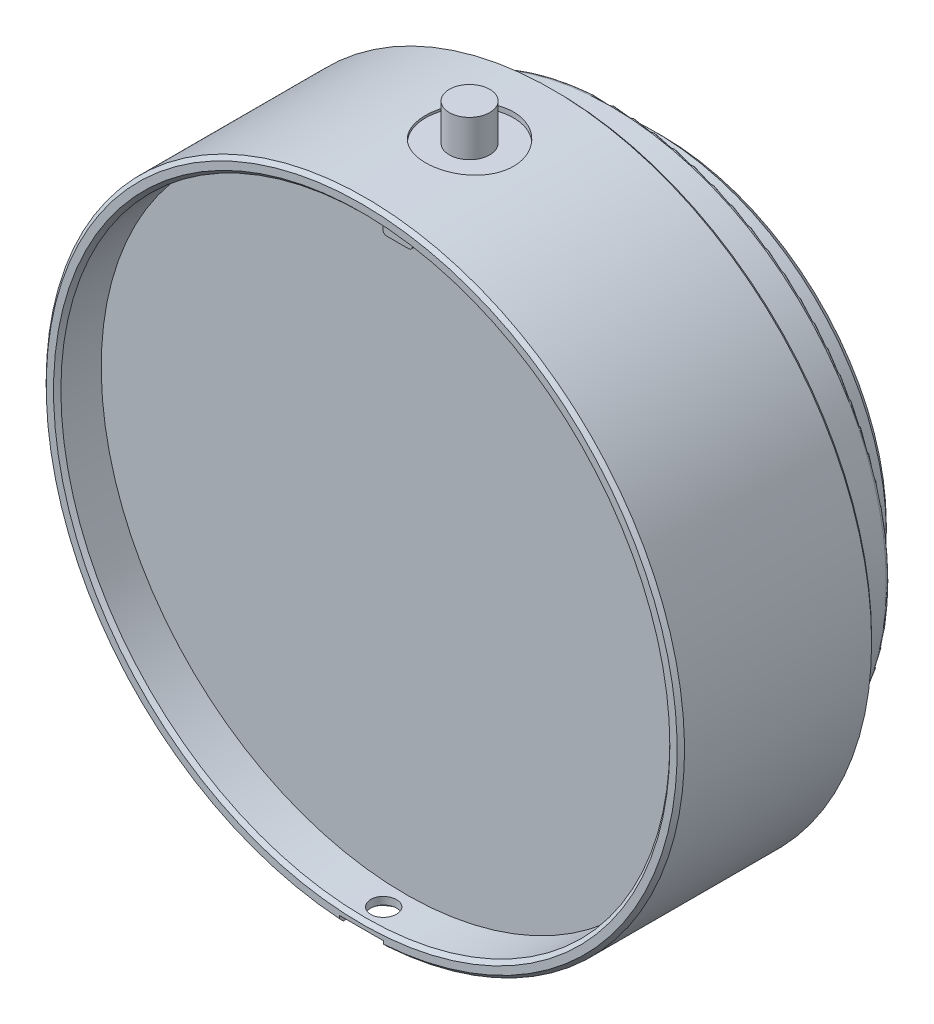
ISO-10303-21;
HEADER;
FILE_DESCRIPTION(('STEP AP214'),'2;1');
FILE_NAME('part.step','',(''),(''),'','','');
FILE_SCHEMA(('AUTOMOTIVE_DESIGN { 1 0 10303 214 1 1 1 1 }'));
ENDSEC;
DATA;
#1=APPLICATION_CONTEXT('core data for automotive mechanical design processes');
#2=APPLICATION_PROTOCOL_DEFINITION('international standard','automotive_design',2000,#1);
#3=PRODUCT_CONTEXT('',#1,'mechanical');
#4=PRODUCT('Part','Part','',(#3));
#5=PRODUCT_RELATED_PRODUCT_CATEGORY('part','',(#4));
#6=PRODUCT_DEFINITION_FORMATION('','',#4);
#7=PRODUCT_DEFINITION_CONTEXT('part definition',#1,'design');
#8=PRODUCT_DEFINITION('design','',#6,#7);
#9=PRODUCT_DEFINITION_SHAPE('','',#8);
#10=(LENGTH_UNIT() NAMED_UNIT(*) SI_UNIT(.MILLI.,.METRE.));
#11=(NAMED_UNIT(*) PLANE_ANGLE_UNIT() SI_UNIT($,.RADIAN.));
#12=(NAMED_UNIT(*) SI_UNIT($,.STERADIAN.) SOLID_ANGLE_UNIT());
#13=UNCERTAINTY_MEASURE_WITH_UNIT(LENGTH_MEASURE(1.E-05),#10,'distance_accuracy_value','');
#14=(GEOMETRIC_REPRESENTATION_CONTEXT(3) GLOBAL_UNCERTAINTY_ASSIGNED_CONTEXT((#13)) GLOBAL_UNIT_ASSIGNED_CONTEXT((#10,
#11,#12)) REPRESENTATION_CONTEXT('',''));
#15=CARTESIAN_POINT('',(0.,0.,0.));
#16=DIRECTION('',(0.,0.,1.));
#17=DIRECTION('',(1.,0.,0.));
#18=AXIS2_PLACEMENT_3D('',#15,#16,#17);
#19=CARTESIAN_POINT('',(0.,47.8,19.8));
#20=DIRECTION('',(0.,1.,0.));
#21=DIRECTION('',(1.,0.,0.));
#22=AXIS2_PLACEMENT_3D('',#19,#20,#21);
#23=PLANE('',#22);
#24=CARTESIAN_POINT('',(0.,47.8,19.8));
#25=DIRECTION('',(0.,1.,0.));
#26=DIRECTION('',(0.,0.,1.));
#27=AXIS2_PLACEMENT_3D('',#24,#25,#26);
#28=CIRCLE('',#27,2.75);
#29=CARTESIAN_POINT('',(0.,47.8,22.55));
#30=VERTEX_POINT('',#29);
#31=EDGE_CURVE('E11',#30,#30,#28,.T.);
#32=ORIENTED_EDGE('',*,*,#31,.T.);
#33=EDGE_LOOP('',(#32));
#34=FACE_BOUND('',#33,.T.);
#35=ADVANCED_FACE('F16',(#34),#23,.T.);
#36=CARTESIAN_POINT('',(0.,47.8,19.8));
#37=DIRECTION('',(0.,-1.,0.));
#38=DIRECTION('',(0.,0.,-1.));
#39=AXIS2_PLACEMENT_3D('',#36,#37,#38);
#40=CYLINDRICAL_SURFACE('',#39,2.75);
#41=ORIENTED_EDGE('',*,*,#31,.F.);
#42=EDGE_LOOP('',(#41));
#43=FACE_BOUND('',#42,.T.);
#44=CARTESIAN_POINT('',(0.,42.8,19.8));
#45=DIRECTION('',(0.,1.,0.));
#46=DIRECTION('',(0.,0.,1.));
#47=AXIS2_PLACEMENT_3D('',#44,#45,#46);
#48=CIRCLE('',#47,2.75);
#49=CARTESIAN_POINT('',(0.,42.8,22.55));
#50=VERTEX_POINT('',#49);
#51=EDGE_CURVE('E32',#50,#50,#48,.T.);
#52=ORIENTED_EDGE('',*,*,#51,.T.);
#53=EDGE_LOOP('',(#52));
#54=FACE_BOUND('',#53,.T.);
#55=ADVANCED_FACE('F286',(#43,#54),#40,.T.);
#56=CARTESIAN_POINT('',(0.,0.,8.));
#57=DIRECTION('',(0.,0.,1.));
#58=DIRECTION('',(1.,0.,0.));
#59=AXIS2_PLACEMENT_3D('',#56,#57,#58);
#60=CONICAL_SURFACE('',#59,43.,0.785398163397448);
#61=CARTESIAN_POINT('',(0.,0.,8.));
#62=DIRECTION('',(0.,0.,-1.));
#63=DIRECTION('',(-1.,0.,0.));
#64=AXIS2_PLACEMENT_3D('',#61,#62,#63);
#65=CIRCLE('',#64,43.);
#66=CARTESIAN_POINT('',(-43.,0.,8.));
#67=VERTEX_POINT('',#66);
#68=EDGE_CURVE('E355',#67,#67,#65,.T.);
#69=ORIENTED_EDGE('',*,*,#68,.F.);
#70=EDGE_LOOP('',(#69));
#71=FACE_BOUND('',#70,.T.);
#72=CARTESIAN_POINT('',(0.,0.,8.5));
#73=DIRECTION('',(0.,0.,1.));
#74=DIRECTION('',(-1.,0.,0.));
#75=AXIS2_PLACEMENT_3D('',#72,#73,#74);
#76=CIRCLE('',#75,43.5);
#77=CARTESIAN_POINT('',(-43.5,0.,8.5));
#78=VERTEX_POINT('',#77);
#79=EDGE_CURVE('E344',#78,#78,#76,.T.);
#80=ORIENTED_EDGE('',*,*,#79,.F.);
#81=EDGE_LOOP('',(#80));
#82=FACE_BOUND('',#81,.T.);
#83=ADVANCED_FACE('F284',(#71,#82),#60,.T.);
#84=CARTESIAN_POINT('',(0.,42.8,19.8));
#85=DIRECTION('',(0.,1.,0.));
#86=DIRECTION('',(0.,0.,1.));
#87=AXIS2_PLACEMENT_3D('',#84,#85,#86);
#88=CYLINDRICAL_SURFACE('',#87,6.);
#89=CARTESIAN_POINT('',(0.,42.8,19.8));
#90=DIRECTION('',(0.,1.,0.));
#91=DIRECTION('',(0.,0.,1.));
#92=AXIS2_PLACEMENT_3D('',#89,#90,#91);
#93=CIRCLE('',#92,6.);
#94=CARTESIAN_POINT('',(0.,42.8,25.8));
#95=VERTEX_POINT('',#94);
#96=EDGE_CURVE('E245',#95,#95,#93,.T.);
#97=ORIENTED_EDGE('',*,*,#96,.F.);
#98=EDGE_LOOP('',(#97));
#99=FACE_BOUND('',#98,.T.);
#100=CARTESIAN_POINT('',(0.,43.5,25.8));
#101=CARTESIAN_POINT('',(0.167716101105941,43.5000007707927,25.8000021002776));
#102=CARTESIAN_POINT('',(0.335402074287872,43.4990281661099,25.7929654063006));
#103=CARTESIAN_POINT('',(0.669626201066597,43.4951665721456,25.7648737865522));
#104=CARTESIAN_POINT('',(0.836164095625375,43.4922771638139,25.7438157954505));
#105=CARTESIAN_POINT('',(1.16696355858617,43.4846593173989,25.6878146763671));
#106=CARTESIAN_POINT('',(1.33122341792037,43.4799295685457,25.6528616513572));
#107=CARTESIAN_POINT('',(1.65624284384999,43.4687624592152,25.5693173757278));
#108=CARTESIAN_POINT('',(1.81700110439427,43.4623244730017,25.5207211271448));
#109=CARTESIAN_POINT('',(2.13364592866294,43.447930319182,25.4103153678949));
#110=CARTESIAN_POINT('',(2.28953761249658,43.4399758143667,25.348520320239));
#111=CARTESIAN_POINT('',(2.59560091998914,43.4227631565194,25.2121102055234));
#112=CARTESIAN_POINT('',(2.74577041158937,43.4135045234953,25.1374904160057));
#113=CARTESIAN_POINT('',(3.03920957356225,43.3939491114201,24.9760250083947));
#114=CARTESIAN_POINT('',(3.18248287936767,43.3836528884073,24.8891859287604));
#115=CARTESIAN_POINT('',(3.46128214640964,43.3623002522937,24.703830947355));
#116=CARTESIAN_POINT('',(3.59680520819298,43.3512435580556,24.6053107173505));
#117=CARTESIAN_POINT('',(3.85985011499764,43.328617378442,24.3967258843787));
#118=CARTESIAN_POINT('',(3.98732313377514,43.3170453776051,24.2865999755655));
#119=CARTESIAN_POINT('',(4.23260117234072,43.293767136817,24.0559879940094));
#120=CARTESIAN_POINT('',(4.35040259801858,43.2820608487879,23.935498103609));
#121=CARTESIAN_POINT('',(4.57543117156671,43.2588513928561,23.6850686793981));
#122=CARTESIAN_POINT('',(4.68266162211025,43.2473481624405,23.5551321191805));
#123=CARTESIAN_POINT('',(4.88587729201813,43.2248616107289,23.2866261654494));
#124=CARTESIAN_POINT('',(4.98185834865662,43.213878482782,23.1480536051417));
#125=CARTESIAN_POINT('',(5.16219009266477,43.1927085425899,22.8627405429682));
#126=CARTESIAN_POINT('',(5.24649550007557,43.1825248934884,22.7159711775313));
#127=CARTESIAN_POINT('',(5.40246429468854,43.1632894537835,22.4157243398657));
#128=CARTESIAN_POINT('',(5.47412297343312,43.154238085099,22.2622443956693));
#129=CARTESIAN_POINT('',(5.60420740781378,43.1375378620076,21.9497612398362));
#130=CARTESIAN_POINT('',(5.66263852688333,43.1298884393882,21.7907602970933));
#131=CARTESIAN_POINT('',(5.76588638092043,43.1162060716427,21.4683131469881));
#132=CARTESIAN_POINT('',(5.81069812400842,43.1101737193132,21.3048653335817));
#133=CARTESIAN_POINT('',(5.92360753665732,43.0948598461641,20.8118180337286));
#134=CARTESIAN_POINT('',(5.97115549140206,43.0882318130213,20.4771615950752));
#135=CARTESIAN_POINT('',(6.00945415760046,43.0829060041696,19.8047419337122));
#136=CARTESIAN_POINT('',(6.00020763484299,43.0842078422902,19.4669788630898));
#137=CARTESIAN_POINT('',(5.92554550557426,43.0945390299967,18.8001976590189));
#138=CARTESIAN_POINT('',(5.8605224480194,43.1035143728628,18.4711349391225));
#139=CARTESIAN_POINT('',(5.67674647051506,43.1281006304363,17.8286490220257));
#140=CARTESIAN_POINT('',(5.55799224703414,43.1437117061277,17.5152262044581));
#141=CARTESIAN_POINT('',(5.26971501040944,43.179869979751,16.9116937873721));
#142=CARTESIAN_POINT('',(5.10002350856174,43.2004335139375,16.6216656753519));
#143=CARTESIAN_POINT('',(4.71480746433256,43.2441677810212,16.0740535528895));
#144=CARTESIAN_POINT('',(4.49928037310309,43.2673386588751,15.8164713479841));
#145=CARTESIAN_POINT('',(4.02634568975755,43.3139162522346,15.3387842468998));
#146=CARTESIAN_POINT('',(3.76860006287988,43.3373233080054,15.1190139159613));
#147=CARTESIAN_POINT('',(3.21970269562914,43.3815536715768,14.7258015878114));
#148=CARTESIAN_POINT('',(2.92855084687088,43.4023769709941,14.552359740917));
#149=CARTESIAN_POINT('',(2.32083195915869,43.4391106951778,14.2567190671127));
#150=CARTESIAN_POINT('',(2.00425341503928,43.4550188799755,14.13454359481));
#151=CARTESIAN_POINT('',(1.35480517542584,43.4801105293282,13.9451818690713));
#152=CARTESIAN_POINT('',(1.02193641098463,43.489294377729,13.8779924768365));
#153=CARTESIAN_POINT('',(0.35224685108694,43.4998522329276,13.8009493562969));
#154=CARTESIAN_POINT('',(0.0154799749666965,43.5012889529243,13.7906352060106));
#155=CARTESIAN_POINT('',(-0.654977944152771,43.4963606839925,13.8264168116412));
#156=CARTESIAN_POINT('',(-0.988669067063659,43.4899958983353,13.872511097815));
#157=CARTESIAN_POINT('',(-1.64212679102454,43.470218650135,14.0194183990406));
#158=CARTESIAN_POINT('',(-1.96194421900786,43.4568347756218,14.1200095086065));
#159=CARTESIAN_POINT('',(-2.58017265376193,43.4245163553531,14.372822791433));
#160=CARTESIAN_POINT('',(-2.8785827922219,43.4055815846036,14.5250470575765));
#161=CARTESIAN_POINT('',(-3.4475665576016,43.3641126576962,14.8779024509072));
#162=CARTESIAN_POINT('',(-3.71795564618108,43.3415568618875,15.0788285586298));
#163=CARTESIAN_POINT('',(-4.2213386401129,43.2954306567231,15.5229712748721));
#164=CARTESIAN_POINT('',(-4.45433072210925,43.2718601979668,15.7661899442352));
#165=CARTESIAN_POINT('',(-4.87796067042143,43.2261648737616,16.2900482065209));
#166=CARTESIAN_POINT('',(-5.06829160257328,43.2040512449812,16.5709371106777));
#167=CARTESIAN_POINT('',(-5.39906797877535,43.1639658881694,17.1609811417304));
#168=CARTESIAN_POINT('',(-5.53951460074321,43.1459940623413,17.4701356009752));
#169=CARTESIAN_POINT('',(-5.76605510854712,43.1163041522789,18.1069184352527));
#170=CARTESIAN_POINT('',(-5.85231630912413,43.1045668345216,18.4344865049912));
#171=CARTESIAN_POINT('',(-5.96855093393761,43.0886295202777,19.0998180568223));
#172=CARTESIAN_POINT('',(-5.99852759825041,43.0844290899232,19.4375809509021));
#173=CARTESIAN_POINT('',(-6.0006535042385,43.0841267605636,19.942625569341));
#174=CARTESIAN_POINT('',(-5.99432494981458,43.0850113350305,20.110083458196));
#175=CARTESIAN_POINT('',(-5.96769901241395,43.0887084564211,20.4438467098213));
#176=CARTESIAN_POINT('',(-5.94740684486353,43.091520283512,20.6101524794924));
#177=CARTESIAN_POINT('',(-5.89298949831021,43.0989955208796,20.940492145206));
#178=CARTESIAN_POINT('',(-5.85885931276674,43.1036596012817,21.1045251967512));
#179=CARTESIAN_POINT('',(-5.77703836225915,43.1147020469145,21.4290537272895));
#180=CARTESIAN_POINT('',(-5.72935251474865,43.1210797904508,21.5895504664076));
#181=CARTESIAN_POINT('',(-5.62077540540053,43.1353669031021,21.9059079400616));
#182=CARTESIAN_POINT('',(-5.55988658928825,43.1432759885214,22.061769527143));
#183=CARTESIAN_POINT('',(-5.42536460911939,43.1603986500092,22.3677497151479));
#184=CARTESIAN_POINT('',(-5.35173605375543,43.1696117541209,22.5178703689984));
#185=CARTESIAN_POINT('',(-5.19221493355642,43.1890884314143,22.8114487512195));
#186=CARTESIAN_POINT('',(-5.10631778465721,43.1993523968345,22.9549039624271));
#187=CARTESIAN_POINT('',(-4.92291776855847,43.2206362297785,23.2340590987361));
#188=CARTESIAN_POINT('',(-4.82541904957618,43.2316558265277,23.3697617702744));
#189=CARTESIAN_POINT('',(-4.61859088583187,43.2542428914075,23.633661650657));
#190=CARTESIAN_POINT('',(-4.50916786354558,43.2658142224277,23.7617852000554));
#191=CARTESIAN_POINT('',(-4.27998679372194,43.2890860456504,24.0083286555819));
#192=CARTESIAN_POINT('',(-4.16023249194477,43.3007864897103,24.126752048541));
#193=CARTESIAN_POINT('',(-3.91111004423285,43.3239988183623,24.353193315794));
#194=CARTESIAN_POINT('',(-3.78173615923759,43.33551058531,24.4612048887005));
#195=CARTESIAN_POINT('',(-3.51438403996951,43.3580106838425,24.6659473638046));
#196=CARTESIAN_POINT('',(-3.37640900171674,43.3689992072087,24.7626824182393));
#197=CARTESIAN_POINT('',(-3.09205573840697,43.390201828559,24.9446893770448));
#198=CARTESIAN_POINT('',(-2.94563886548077,43.4004117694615,25.0299014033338));
#199=CARTESIAN_POINT('',(-2.64612308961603,43.4197022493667,25.1876406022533));
#200=CARTESIAN_POINT('',(-2.4930266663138,43.4287832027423,25.2601724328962));
#201=CARTESIAN_POINT('',(-2.18129882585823,43.4455552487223,25.3920074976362));
#202=CARTESIAN_POINT('',(-2.02267170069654,43.4532473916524,25.4513207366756));
#203=CARTESIAN_POINT('',(-1.7009615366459,43.467029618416,25.5563326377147));
#204=CARTESIAN_POINT('',(-1.53787953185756,43.4731200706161,25.6020344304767));
#205=CARTESIAN_POINT('',(-1.14843626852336,43.4854174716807,25.6935832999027));
#206=CARTESIAN_POINT('',(-0.920617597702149,43.4908623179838,25.733446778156));
#207=CARTESIAN_POINT('',(-0.461846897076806,43.4981530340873,25.7866535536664));
#208=CARTESIAN_POINT('',(-0.230894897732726,43.499998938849,25.799997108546));
#209=CARTESIAN_POINT('',(0.,43.5,25.8));
#210=B_SPLINE_CURVE_WITH_KNOTS('',3,(#100,#101,#102,#103,#104,#105,#106,#107,#108,#109,#110,
#111,#112,#113,#114,#115,#116,#117,#118,#119,#120,#121,#122,#123,#124,#125,#126,#127,#128,#129,
#130,#131,#132,#133,#134,#135,#136,#137,#138,#139,#140,#141,#142,#143,#144,#145,#146,#147,#148,
#149,#150,#151,#152,#153,#154,#155,#156,#157,#158,#159,#160,#161,#162,#163,#164,#165,#166,#167,
#168,#169,#170,#171,#172,#173,#174,#175,#176,#177,#178,#179,#180,#181,#182,#183,#184,#185,#186,
#187,#188,#189,#190,#191,#192,#193,#194,#195,#196,#197,#198,#199,#200,#201,#202,#203,#204,#205,
#206,#207,#208,#209),.UNSPECIFIED.,.T.,.F.,(4,2,2,2,2,2,2,2,2,2,2,2,2,2,2,2,2,2,2,2,2,2,2,2,2,2,
2,2,2,2,2,2,2,2,2,2,2,2,2,2,2,2,2,2,2,2,2,2,2,2,2,2,2,2,4),(0.,0.502946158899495,
1.00600230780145,1.50941741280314,2.01301717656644,2.51606791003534,3.01930428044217,
3.52227238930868,4.02542744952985,4.53138798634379,5.03753570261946,5.54352477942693,
6.04970050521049,6.55778735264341,7.06606296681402,7.57413211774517,8.08238726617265,
9.09134316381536,10.1002499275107,11.1021138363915,12.1040020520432,13.109241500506,
14.1145368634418,15.1283147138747,16.1420958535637,17.1563383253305,18.170522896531,
19.1764851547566,20.1824212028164,21.1842916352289,22.1862026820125,23.1943408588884,
24.2025281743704,25.217751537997,26.2329509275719,27.2449999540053,28.256990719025,
28.7592409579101,29.2613037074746,29.7635482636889,30.2656108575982,30.7675805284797,
31.269368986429,31.7713454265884,32.2731429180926,32.7792086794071,33.2850917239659,
33.7912790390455,34.2972793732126,34.8058155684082,35.3141645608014,35.8221274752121,
36.3299734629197,37.0223865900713,37.7147929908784),.UNSPECIFIED.);
#211=CARTESIAN_POINT('',(0.,43.5,25.8));
#212=VERTEX_POINT('',#211);
#213=EDGE_CURVE('E260',#212,#212,#210,.F.);
#214=ORIENTED_EDGE('',*,*,#213,.F.);
#215=EDGE_LOOP('',(#214));
#216=FACE_BOUND('',#215,.T.);
#217=ADVANCED_FACE('F280',(#99,#216),#88,.F.);
#218=CARTESIAN_POINT('',(0.,42.8,19.8));
#219=DIRECTION('',(0.,1.,0.));
#220=DIRECTION('',(1.,0.,0.));
#221=AXIS2_PLACEMENT_3D('',#218,#219,#220);
#222=PLANE('',#221);
#223=ORIENTED_EDGE('',*,*,#51,.F.);
#224=EDGE_LOOP('',(#223));
#225=FACE_BOUND('',#224,.T.);
#226=ORIENTED_EDGE('',*,*,#96,.T.);
#227=EDGE_LOOP('',(#226));
#228=FACE_BOUND('',#227,.T.);
#229=ADVANCED_FACE('F276',(#225,#228),#222,.T.);
#230=CARTESIAN_POINT('',(0.,-23.5,31.5));
#231=DIRECTION('',(0.,-1.,0.));
#232=DIRECTION('',(0.,0.,-1.));
#233=AXIS2_PLACEMENT_3D('',#230,#231,#232);
#234=CYLINDRICAL_SURFACE('',#233,1.75);
#235=CARTESIAN_POINT('',(0.,-42.5,31.5));
#236=DIRECTION('',(0.,-1.,0.));
#237=DIRECTION('',(0.,0.,-1.));
#238=AXIS2_PLACEMENT_3D('',#235,#236,#237);
#239=CIRCLE('',#238,1.75);
#240=CARTESIAN_POINT('',(0.,-42.5,29.75));
#241=VERTEX_POINT('',#240);
#242=EDGE_CURVE('E241',#241,#241,#239,.T.);
#243=ORIENTED_EDGE('',*,*,#242,.T.);
#244=EDGE_LOOP('',(#243));
#245=FACE_BOUND('',#244,.T.);
#246=CARTESIAN_POINT('',(0.,-41.5,29.75));
#247=CARTESIAN_POINT('',(0.098251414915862,-41.4999995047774,29.7500043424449));
#248=CARTESIAN_POINT('',(0.196572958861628,-41.4996473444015,29.7583020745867));
#249=CARTESIAN_POINT('',(0.390505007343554,-41.4982763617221,29.791286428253));
#250=CARTESIAN_POINT('',(0.486112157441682,-41.4972567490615,29.8159924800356));
#251=CARTESIAN_POINT('',(0.671777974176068,-41.4946662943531,29.8810860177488));
#252=CARTESIAN_POINT('',(0.761839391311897,-41.4930957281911,29.921465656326));
#253=CARTESIAN_POINT('',(0.933880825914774,-41.4895803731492,30.0167484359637));
#254=CARTESIAN_POINT('',(1.01586277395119,-41.4876356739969,30.0716480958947));
#255=CARTESIAN_POINT('',(1.16950521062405,-41.4835892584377,30.1944596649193));
#256=CARTESIAN_POINT('',(1.24115886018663,-41.4814874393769,30.2623801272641));
#257=CARTESIAN_POINT('',(1.37205264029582,-41.4773645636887,30.4092887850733));
#258=CARTESIAN_POINT('',(1.43129226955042,-41.4753435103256,30.4882774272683));
#259=CARTESIAN_POINT('',(1.53569307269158,-41.4716094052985,30.6551133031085));
#260=CARTESIAN_POINT('',(1.58084924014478,-41.4698964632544,30.7429636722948));
#261=CARTESIAN_POINT('',(1.65576908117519,-41.4669729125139,30.9250071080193));
#262=CARTESIAN_POINT('',(1.68553284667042,-41.4657623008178,31.0192001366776));
#263=CARTESIAN_POINT('',(1.72880583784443,-41.4639808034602,31.2111951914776));
#264=CARTESIAN_POINT('',(1.74232481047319,-41.4634095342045,31.3089950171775));
#265=CARTESIAN_POINT('',(1.75275452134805,-41.4629699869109,31.505477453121));
#266=CARTESIAN_POINT('',(1.74966536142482,-41.4631017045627,31.6041600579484));
#267=CARTESIAN_POINT('',(1.72697464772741,-41.4640529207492,31.7995406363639));
#268=CARTESIAN_POINT('',(1.70738362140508,-41.4648719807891,31.8962398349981));
#269=CARTESIAN_POINT('',(1.65226159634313,-41.4671048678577,32.0849757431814));
#270=CARTESIAN_POINT('',(1.61673054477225,-41.4685186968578,32.1770124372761));
#271=CARTESIAN_POINT('',(1.53072501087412,-41.4717822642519,32.3538446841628));
#272=CARTESIAN_POINT('',(1.48024571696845,-41.4736321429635,32.438637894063));
#273=CARTESIAN_POINT('',(1.36578014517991,-41.477559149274,32.5985505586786));
#274=CARTESIAN_POINT('',(1.30179380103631,-41.4796362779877,32.6736699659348));
#275=CARTESIAN_POINT('',(1.16207099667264,-41.4837856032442,32.812163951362));
#276=CARTESIAN_POINT('',(1.08632541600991,-41.4858577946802,32.8755293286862));
#277=CARTESIAN_POINT('',(0.925266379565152,-41.4897621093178,32.9886456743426));
#278=CARTESIAN_POINT('',(0.839952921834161,-41.4915942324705,33.0383966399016));
#279=CARTESIAN_POINT('',(0.662174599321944,-41.4948119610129,33.1228709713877));
#280=CARTESIAN_POINT('',(0.569709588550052,-41.4961975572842,33.1575940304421));
#281=CARTESIAN_POINT('',(0.380255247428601,-41.4983659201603,33.2110209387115));
#282=CARTESIAN_POINT('',(0.283265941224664,-41.4991486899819,33.2297248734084));
#283=CARTESIAN_POINT('',(0.0875960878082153,-41.5000227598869,33.2505712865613));
#284=CARTESIAN_POINT('',(-0.0110831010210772,-41.5001145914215,33.2527264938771));
#285=CARTESIAN_POINT('',(-0.207401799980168,-41.4995978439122,33.2404474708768));
#286=CARTESIAN_POINT('',(-0.305041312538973,-41.4989892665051,33.2260132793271));
#287=CARTESIAN_POINT('',(-0.496473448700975,-41.4971406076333,33.1809757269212));
#288=CARTESIAN_POINT('',(-0.590267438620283,-41.4959007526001,33.1503781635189));
#289=CARTESIAN_POINT('',(-0.771388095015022,-41.4929291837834,33.0738882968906));
#290=CARTESIAN_POINT('',(-0.858714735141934,-41.4911974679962,33.0279959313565));
#291=CARTESIAN_POINT('',(-1.02448032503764,-41.4874357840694,32.9221864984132));
#292=CARTESIAN_POINT('',(-1.10291381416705,-41.4854056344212,32.8622608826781));
#293=CARTESIAN_POINT('',(-1.24861178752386,-41.4812763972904,32.7300985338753));
#294=CARTESIAN_POINT('',(-1.31587621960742,-41.479177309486,32.6578617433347));
#295=CARTESIAN_POINT('',(-1.43736939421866,-41.4751452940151,32.5030729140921));
#296=CARTESIAN_POINT('',(-1.49158991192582,-41.4732124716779,32.4205144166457));
#297=CARTESIAN_POINT('',(-1.58539993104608,-41.4697325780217,32.2474584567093));
#298=CARTESIAN_POINT('',(-1.62498948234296,-41.4681855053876,32.1569610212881));
#299=CARTESIAN_POINT('',(-1.68839938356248,-41.4656523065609,31.9706267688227));
#300=CARTESIAN_POINT('',(-1.71222501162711,-41.4646659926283,31.8747917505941));
#301=CARTESIAN_POINT('',(-1.74344802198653,-41.4633649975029,31.6804774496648));
#302=CARTESIAN_POINT('',(-1.75084546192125,-41.4630503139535,31.5819981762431));
#303=CARTESIAN_POINT('',(-1.74900150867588,-41.4631281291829,31.3852728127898));
#304=CARTESIAN_POINT('',(-1.73977306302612,-41.4635200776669,31.2870266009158));
#305=CARTESIAN_POINT('',(-1.70496601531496,-41.464965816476,31.0934795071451));
#306=CARTESIAN_POINT('',(-1.67938738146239,-41.4660196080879,30.9981786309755));
#307=CARTESIAN_POINT('',(-1.61260845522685,-41.4686701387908,30.8132241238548));
#308=CARTESIAN_POINT('',(-1.57140796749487,-41.4702668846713,30.7235705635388));
#309=CARTESIAN_POINT('',(-1.47455761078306,-41.4738232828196,30.5524533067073));
#310=CARTESIAN_POINT('',(-1.41890822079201,-41.4757829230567,30.4709893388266));
#311=CARTESIAN_POINT('',(-1.29469522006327,-41.4798459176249,30.3185002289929));
#312=CARTESIAN_POINT('',(-1.22612297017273,-41.4819493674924,30.247482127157));
#313=CARTESIAN_POINT('',(-1.07800919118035,-41.4860623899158,30.1179448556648));
#314=CARTESIAN_POINT('',(-0.998464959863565,-41.4880719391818,30.0594287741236));
#315=CARTESIAN_POINT('',(-0.830616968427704,-41.4917717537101,29.9565371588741));
#316=CARTESIAN_POINT('',(-0.742306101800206,-41.4934617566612,29.912173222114));
#317=CARTESIAN_POINT('',(-0.559549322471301,-41.4963278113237,29.8389542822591));
#318=CARTESIAN_POINT('',(-0.465110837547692,-41.497504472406,29.8100808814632));
#319=CARTESIAN_POINT('',(-0.308400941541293,-41.4988985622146,29.7762715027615));
#320=CARTESIAN_POINT('',(-0.247145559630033,-41.499309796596,29.7664321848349));
#321=CARTESIAN_POINT('',(-0.123936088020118,-41.4998606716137,29.7532950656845));
#322=CARTESIAN_POINT('',(-0.0619819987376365,-41.5000003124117,29.7499972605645));
#323=CARTESIAN_POINT('',(0.,-41.5,29.75));
#324=B_SPLINE_CURVE_WITH_KNOTS('',3,(#246,#247,#248,#249,#250,#251,#252,#253,#254,#255,#256,
#257,#258,#259,#260,#261,#262,#263,#264,#265,#266,#267,#268,#269,#270,#271,#272,#273,#274,#275,
#276,#277,#278,#279,#280,#281,#282,#283,#284,#285,#286,#287,#288,#289,#290,#291,#292,#293,#294,
#295,#296,#297,#298,#299,#300,#301,#302,#303,#304,#305,#306,#307,#308,#309,#310,#311,#312,#313,
#314,#315,#316,#317,#318,#319,#320,#321,#322,#323),.UNSPECIFIED.,.T.,.F.,(4,2,2,2,2,2,2,2,2,2,2,
2,2,2,2,2,2,2,2,2,2,2,2,2,2,2,2,2,2,2,2,2,2,2,2,2,2,2,4),(0.,0.294527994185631,
0.589405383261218,0.884135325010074,1.17879467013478,1.47364824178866,1.76851371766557,
2.06348389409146,2.35845230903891,2.6532436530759,2.94803318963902,3.24263480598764,
3.53723739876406,3.83193492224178,4.1266338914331,4.42156258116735,4.71649133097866,
5.01142610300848,5.30635930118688,5.60106562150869,5.89577125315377,6.19037125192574,
6.48497245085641,6.7797535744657,7.0745360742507,7.36950396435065,7.66447084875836,
7.95933892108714,8.25420595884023,8.54884346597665,8.84348154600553,9.13812331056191,
9.43275530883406,9.72758497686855,10.022487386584,10.3176308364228,10.6124229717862,
10.7982263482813,10.9840296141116),.UNSPECIFIED.);
#325=CARTESIAN_POINT('',(0.,-41.5,29.75));
#326=VERTEX_POINT('',#325);
#327=EDGE_CURVE('E249',#326,#326,#324,.T.);
#328=ORIENTED_EDGE('',*,*,#327,.F.);
#329=EDGE_LOOP('',(#328));
#330=FACE_BOUND('',#329,.T.);
#331=ADVANCED_FACE('F270',(#245,#330),#234,.F.);
#332=CARTESIAN_POINT('',(0.,-42.5,35.5));
#333=DIRECTION('',(0.,-1.,0.));
#334=DIRECTION('',(0.,0.,-1.));
#335=AXIS2_PLACEMENT_3D('',#332,#333,#334);
#336=PLANE('',#335);
#337=ORIENTED_EDGE('',*,*,#242,.F.);
#338=EDGE_LOOP('',(#337));
#339=FACE_BOUND('',#338,.T.);
#340=DIRECTION('',(0.,0.,-1.));
#341=VECTOR('',#340,1.);
#342=CARTESIAN_POINT('',(-3.,-42.5,35.5));
#343=LINE('',#342,#341);
#344=CARTESIAN_POINT('',(-3.,-42.5,34.5));
#345=VERTEX_POINT('',#344);
#346=CARTESIAN_POINT('',(-3.,-42.5,31.5));
#347=VERTEX_POINT('',#346);
#348=EDGE_CURVE('E191',#345,#347,#343,.T.);
#349=ORIENTED_EDGE('',*,*,#348,.T.);
#350=CARTESIAN_POINT('',(0.,-42.5,31.5));
#351=DIRECTION('',(0.,-1.,0.));
#352=DIRECTION('',(0.,0.,-1.));
#353=AXIS2_PLACEMENT_3D('',#350,#351,#352);
#354=CIRCLE('',#353,3.);
#355=CARTESIAN_POINT('',(3.,-42.5,31.5));
#356=VERTEX_POINT('',#355);
#357=EDGE_CURVE('E190',#347,#356,#354,.T.);
#358=ORIENTED_EDGE('',*,*,#357,.T.);
#359=DIRECTION('',(0.,0.,1.));
#360=VECTOR('',#359,1.);
#361=CARTESIAN_POINT('',(3.,-42.5,35.5));
#362=LINE('',#361,#360);
#363=CARTESIAN_POINT('',(3.,-42.5,34.5));
#364=VERTEX_POINT('',#363);
#365=EDGE_CURVE('E236',#356,#364,#362,.T.);
#366=ORIENTED_EDGE('',*,*,#365,.T.);
#367=DIRECTION('',(1.,0.,0.));
#368=VECTOR('',#367,1.);
#369=CARTESIAN_POINT('',(0.,-42.5,34.5));
#370=LINE('',#369,#368);
#371=EDGE_CURVE('E361',#345,#364,#370,.T.);
#372=ORIENTED_EDGE('',*,*,#371,.F.);
#373=EDGE_LOOP('',(#349,#358,#366,#372));
#374=FACE_BOUND('',#373,.T.);
#375=ADVANCED_FACE('F275',(#339,#374),#336,.T.);
#376=CARTESIAN_POINT('',(-3.,-42.5,35.5));
#377=DIRECTION('',(-1.,0.,0.));
#378=DIRECTION('',(0.,1.,0.));
#379=AXIS2_PLACEMENT_3D('',#376,#377,#378);
#380=PLANE('',#379);
#381=DIRECTION('',(0.,-1.,0.));
#382=VECTOR('',#381,1.);
#383=CARTESIAN_POINT('',(-3.,0.,34.5));
#384=LINE('',#383,#382);
#385=CARTESIAN_POINT('',(-3.,-42.8952211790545,34.5));
#386=VERTEX_POINT('',#385);
#387=EDGE_CURVE('E315',#345,#386,#384,.T.);
#388=ORIENTED_EDGE('',*,*,#387,.T.);
#389=DIRECTION('',(0.,-0.707968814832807,-0.706243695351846));
#390=VECTOR('',#389,1.);
#391=CARTESIAN_POINT('',(-3.,-43.1458265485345,34.2500017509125));
#392=LINE('',#391,#390);
#393=CARTESIAN_POINT('',(-3.,-43.3964284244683,34.));
#394=VERTEX_POINT('',#393);
#395=EDGE_CURVE('E235',#386,#394,#392,.T.);
#396=ORIENTED_EDGE('',*,*,#395,.T.);
#397=DIRECTION('',(0.,0.,1.));
#398=VECTOR('',#397,1.);
#399=CARTESIAN_POINT('',(-3.,-43.3964284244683,34.5));
#400=LINE('',#399,#398);
#401=CARTESIAN_POINT('',(-3.,-43.3964284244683,31.5));
#402=VERTEX_POINT('',#401);
#403=EDGE_CURVE('E348',#402,#394,#400,.T.);
#404=ORIENTED_EDGE('',*,*,#403,.F.);
#405=DIRECTION('',(0.,-1.,0.));
#406=VECTOR('',#405,1.);
#407=CARTESIAN_POINT('',(-3.,-42.5,31.5));
#408=LINE('',#407,#406);
#409=EDGE_CURVE('E192',#347,#402,#408,.T.);
#410=ORIENTED_EDGE('',*,*,#409,.F.);
#411=ORIENTED_EDGE('',*,*,#348,.F.);
#412=EDGE_LOOP('',(#388,#396,#404,#410,#411));
#413=FACE_BOUND('',#412,.T.);
#414=ADVANCED_FACE('F521',(#413),#380,.F.);
#415=CARTESIAN_POINT('',(0.,-42.5,31.5));
#416=DIRECTION('',(0.,-1.,0.));
#417=DIRECTION('',(0.,0.,-1.));
#418=AXIS2_PLACEMENT_3D('',#415,#416,#417);
#419=CYLINDRICAL_SURFACE('',#418,3.);
#420=ORIENTED_EDGE('',*,*,#409,.T.);
#421=CARTESIAN_POINT('',(3.,-43.3964284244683,31.5));
#422=CARTESIAN_POINT('',(3.00000820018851,-43.3964260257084,31.4157289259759));
#423=CARTESIAN_POINT('',(2.9964492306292,-43.3966738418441,31.3314618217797));
#424=CARTESIAN_POINT('',(2.9822604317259,-43.3976521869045,31.1635324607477));
#425=CARTESIAN_POINT('',(2.97163100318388,-43.3983826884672,31.0798701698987));
#426=CARTESIAN_POINT('',(2.94337606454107,-43.4003079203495,30.9138041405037));
#427=CARTESIAN_POINT('',(2.92575616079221,-43.4015022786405,30.8313994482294));
#428=CARTESIAN_POINT('',(2.88366476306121,-43.4043191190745,30.6683910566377));
#429=CARTESIAN_POINT('',(2.85919333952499,-43.4059415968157,30.5877873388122));
#430=CARTESIAN_POINT('',(2.77570557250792,-43.411388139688,30.3494636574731));
#431=CARTESIAN_POINT('',(2.70660247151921,-43.4157922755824,30.1951536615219));
#432=CARTESIAN_POINT('',(2.54357756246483,-43.425647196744,29.9004342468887));
#433=CARTESIAN_POINT('',(2.44965973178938,-43.4310978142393,29.760022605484));
#434=CARTESIAN_POINT('',(2.23946996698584,-43.4424428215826,29.4967084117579));
#435=CARTESIAN_POINT('',(2.12316462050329,-43.4483378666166,29.3738325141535));
#436=CARTESIAN_POINT('',(1.87156297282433,-43.4599019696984,29.1493213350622));
#437=CARTESIAN_POINT('',(1.73626378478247,-43.465570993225,29.0476892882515));
#438=CARTESIAN_POINT('',(1.45036430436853,-43.4760496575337,28.8684734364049));
#439=CARTESIAN_POINT('',(1.29974948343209,-43.4808584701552,28.7909127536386));
#440=CARTESIAN_POINT('',(0.98760608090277,-43.489067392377,28.6621958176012));
#441=CARTESIAN_POINT('',(0.826078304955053,-43.4924676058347,28.6110376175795));
#442=CARTESIAN_POINT('',(0.496957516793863,-43.4974719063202,28.5366486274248));
#443=CARTESIAN_POINT('',(0.329374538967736,-43.4990788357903,28.5133736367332));
#444=CARTESIAN_POINT('',(-0.0073309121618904,-43.5003251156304,28.4952752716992));
#445=CARTESIAN_POINT('',(-0.176453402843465,-43.4999644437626,28.5004522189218));
#446=CARTESIAN_POINT('',(-0.511128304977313,-43.4973184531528,28.5390753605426));
#447=CARTESIAN_POINT('',(-0.676686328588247,-43.4950364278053,28.5724731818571));
#448=CARTESIAN_POINT('',(-0.999840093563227,-43.4888083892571,28.6665148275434));
#449=CARTESIAN_POINT('',(-1.15743581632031,-43.484862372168,28.7271587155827));
#450=CARTESIAN_POINT('',(-1.46035016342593,-43.4757447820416,28.8740269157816));
#451=CARTESIAN_POINT('',(-1.60565790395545,-43.4705721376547,28.9602736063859));
#452=CARTESIAN_POINT('',(-1.87974504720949,-43.4595835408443,29.1558789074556));
#453=CARTESIAN_POINT('',(-2.00852499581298,-43.4537676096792,29.265236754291));
#454=CARTESIAN_POINT('',(-2.24617408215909,-43.4421329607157,29.5042153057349));
#455=CARTESIAN_POINT('',(-2.35500390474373,-43.4363142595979,29.6338751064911));
#456=CARTESIAN_POINT('',(-2.54939230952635,-43.4253395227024,29.9096964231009));
#457=CARTESIAN_POINT('',(-2.63494364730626,-43.4201836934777,30.05586305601));
#458=CARTESIAN_POINT('',(-2.78034059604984,-43.4111165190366,30.3605935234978));
#459=CARTESIAN_POINT('',(-2.84016884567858,-43.4072060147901,30.5191656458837));
#460=CARTESIAN_POINT('',(-2.93225057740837,-43.4010837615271,30.8440160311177));
#461=CARTESIAN_POINT('',(-2.96454597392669,-43.3988694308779,31.0102821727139));
#462=CARTESIAN_POINT('',(-2.98843971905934,-43.3972261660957,31.2314010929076));
#463=CARTESIAN_POINT('',(-2.99277705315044,-43.3969271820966,31.2850762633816));
#464=CARTESIAN_POINT('',(-2.9985532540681,-43.3965285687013,31.3924936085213));
#465=CARTESIAN_POINT('',(-2.99999693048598,-43.3964286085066,31.4462355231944));
#466=CARTESIAN_POINT('',(-3.,-43.3964284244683,31.5));
#467=B_SPLINE_CURVE_WITH_KNOTS('',3,(#421,#422,#423,#424,#425,#426,#427,#428,#429,#430,#431,
#432,#433,#434,#435,#436,#437,#438,#439,#440,#441,#442,#443,#444,#445,#446,#447,#448,#449,#450,
#451,#452,#453,#454,#455,#456,#457,#458,#459,#460,#461,#462,#463,#464,#465,#466),.UNSPECIFIED.,
.F.,.F.,(4,2,2,2,2,2,2,2,2,2,2,2,2,2,2,2,2,2,2,2,2,2,4),(0.,0.252730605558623,0.505446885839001,
0.757960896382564,1.01047231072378,1.51526220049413,2.01997122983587,2.52543943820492,
3.03098455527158,3.53701379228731,4.0430057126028,4.54819446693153,5.05338893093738,
5.55771919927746,6.06205064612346,6.5668242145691,7.07158110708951,7.5773222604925,
8.0832206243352,8.58945990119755,9.09492712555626,9.25642462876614,9.41765348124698),.UNSPECIFIED.);
#468=CARTESIAN_POINT('',(3.,-43.3964284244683,31.5));
#469=VERTEX_POINT('',#468);
#470=EDGE_CURVE('E19',#469,#402,#467,.T.);
#471=ORIENTED_EDGE('',*,*,#470,.F.);
#472=DIRECTION('',(0.,-1.,0.));
#473=VECTOR('',#472,1.);
#474=CARTESIAN_POINT('',(3.,-42.5,31.5));
#475=LINE('',#474,#473);
#476=EDGE_CURVE('E55',#356,#469,#475,.T.);
#477=ORIENTED_EDGE('',*,*,#476,.F.);
#478=ORIENTED_EDGE('',*,*,#357,.F.);
#479=EDGE_LOOP('',(#420,#471,#477,#478));
#480=FACE_BOUND('',#479,.T.);
#481=ADVANCED_FACE('F515',(#480),#419,.F.);
#482=CARTESIAN_POINT('',(3.,-42.5,35.5));
#483=DIRECTION('',(1.,0.,0.));
#484=DIRECTION('',(0.,0.,1.));
#485=AXIS2_PLACEMENT_3D('',#482,#483,#484);
#486=PLANE('',#485);
#487=DIRECTION('',(0.,1.,0.));
#488=VECTOR('',#487,1.);
#489=CARTESIAN_POINT('',(3.,0.,34.5));
#490=LINE('',#489,#488);
#491=CARTESIAN_POINT('',(3.,-42.8952211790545,34.5));
#492=VERTEX_POINT('',#491);
#493=EDGE_CURVE('E316',#492,#364,#490,.T.);
#494=ORIENTED_EDGE('',*,*,#493,.T.);
#495=ORIENTED_EDGE('',*,*,#365,.F.);
#496=ORIENTED_EDGE('',*,*,#476,.T.);
#497=DIRECTION('',(0.,0.,-1.));
#498=VECTOR('',#497,1.);
#499=CARTESIAN_POINT('',(3.,-43.3964284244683,34.5));
#500=LINE('',#499,#498);
#501=CARTESIAN_POINT('',(3.,-43.3964284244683,34.));
#502=VERTEX_POINT('',#501);
#503=EDGE_CURVE('E310',#502,#469,#500,.T.);
#504=ORIENTED_EDGE('',*,*,#503,.F.);
#505=DIRECTION('',(0.,0.707949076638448,0.706263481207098));
#506=VECTOR('',#505,1.);
#507=CARTESIAN_POINT('',(3.,-43.1458265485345,34.2500017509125));
#508=LINE('',#507,#506);
#509=EDGE_CURVE('E69',#502,#492,#508,.T.);
#510=ORIENTED_EDGE('',*,*,#509,.T.);
#511=EDGE_LOOP('',(#494,#495,#496,#504,#510));
#512=FACE_BOUND('',#511,.T.);
#513=ADVANCED_FACE('F513',(#512),#486,.F.);
#514=CARTESIAN_POINT('',(0.,0.,34.5));
#515=DIRECTION('',(0.,0.,-1.));
#516=DIRECTION('',(-1.,0.,0.));
#517=AXIS2_PLACEMENT_3D('',#514,#515,#516);
#518=CONICAL_SURFACE('',#517,43.,0.785398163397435);
#519=ORIENTED_EDGE('',*,*,#395,.F.);
#520=CARTESIAN_POINT('',(0.,0.,34.5));
#521=DIRECTION('',(0.,0.,1.));
#522=DIRECTION('',(1.,0.,0.));
#523=AXIS2_PLACEMENT_3D('',#520,#521,#522);
#524=CIRCLE('',#523,43.);
#525=EDGE_CURVE('E311',#492,#386,#524,.T.);
#526=ORIENTED_EDGE('',*,*,#525,.F.);
#527=ORIENTED_EDGE('',*,*,#509,.F.);
#528=CARTESIAN_POINT('',(0.,0.,34.));
#529=DIRECTION('',(0.,0.,-1.));
#530=DIRECTION('',(1.,0.,0.));
#531=AXIS2_PLACEMENT_3D('',#528,#529,#530);
#532=CIRCLE('',#531,43.5);
#533=EDGE_CURVE('E307',#394,#502,#532,.T.);
#534=ORIENTED_EDGE('',*,*,#533,.F.);
#535=EDGE_LOOP('',(#519,#526,#527,#534));
#536=FACE_BOUND('',#535,.T.);
#537=ADVANCED_FACE('F511',(#536),#518,.T.);
#538=CARTESIAN_POINT('',(0.,0.,34.));
#539=DIRECTION('',(0.,0.,1.));
#540=DIRECTION('',(1.,0.,0.));
#541=AXIS2_PLACEMENT_3D('',#538,#539,#540);
#542=CONICAL_SURFACE('',#541,41.5,0.785398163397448);
#543=CARTESIAN_POINT('',(0.,0.,34.));
#544=DIRECTION('',(0.,0.,1.));
#545=DIRECTION('',(1.,0.,0.));
#546=AXIS2_PLACEMENT_3D('',#543,#544,#545);
#547=CIRCLE('',#546,41.5);
#548=CARTESIAN_POINT('',(41.5,0.,34.));
#549=VERTEX_POINT('',#548);
#550=EDGE_CURVE('E259',#549,#549,#547,.T.);
#551=ORIENTED_EDGE('',*,*,#550,.F.);
#552=EDGE_LOOP('',(#551));
#553=FACE_BOUND('',#552,.T.);
#554=CARTESIAN_POINT('',(0.,0.,34.5));
#555=DIRECTION('',(0.,0.,-1.));
#556=DIRECTION('',(1.,0.,0.));
#557=AXIS2_PLACEMENT_3D('',#554,#555,#556);
#558=CIRCLE('',#557,42.);
#559=CARTESIAN_POINT('',(42.,0.,34.5));
#560=VERTEX_POINT('',#559);
#561=EDGE_CURVE('E360',#560,#560,#558,.T.);
#562=ORIENTED_EDGE('',*,*,#561,.F.);
#563=EDGE_LOOP('',(#562));
#564=FACE_BOUND('',#563,.T.);
#565=ADVANCED_FACE('F508',(#553,#564),#542,.F.);
#566=CARTESIAN_POINT('',(0.,0.,0.5));
#567=DIRECTION('',(0.,0.,1.));
#568=DIRECTION('',(1.,0.,0.));
#569=AXIS2_PLACEMENT_3D('',#566,#567,#568);
#570=TOROIDAL_SURFACE('',#569,37.,0.5);
#571=CARTESIAN_POINT('',(0.,0.,0.5));
#572=DIRECTION('',(0.,0.,1.));
#573=DIRECTION('',(1.,0.,0.));
#574=AXIS2_PLACEMENT_3D('',#571,#572,#573);
#575=CIRCLE('',#574,37.5);
#576=CARTESIAN_POINT('',(37.5,0.,0.5));
#577=VERTEX_POINT('',#576);
#578=EDGE_CURVE('E326',#577,#577,#575,.T.);
#579=ORIENTED_EDGE('',*,*,#578,.F.);
#580=EDGE_LOOP('',(#579));
#581=FACE_BOUND('',#580,.T.);
#582=CARTESIAN_POINT('',(0.,0.,0.));
#583=DIRECTION('',(0.,0.,-1.));
#584=DIRECTION('',(1.,0.,0.));
#585=AXIS2_PLACEMENT_3D('',#582,#583,#584);
#586=CIRCLE('',#585,37.);
#587=CARTESIAN_POINT('',(37.,0.,0.));
#588=VERTEX_POINT('',#587);
#589=EDGE_CURVE('E231',#588,#588,#586,.T.);
#590=ORIENTED_EDGE('',*,*,#589,.F.);
#591=EDGE_LOOP('',(#590));
#592=FACE_BOUND('',#591,.T.);
#593=ADVANCED_FACE('F504',(#581,#592),#570,.T.);
#594=CARTESIAN_POINT('',(0.,0.,0.));
#595=DIRECTION('',(0.,0.,1.));
#596=DIRECTION('',(1.,0.,0.));
#597=AXIS2_PLACEMENT_3D('',#594,#595,#596);
#598=PLANE('',#597);
#599=CARTESIAN_POINT('',(0.,0.,0.));
#600=DIRECTION('',(0.,0.,-1.));
#601=DIRECTION('',(1.,0.,0.));
#602=AXIS2_PLACEMENT_3D('',#599,#600,#601);
#603=CIRCLE('',#602,31.5);
#604=CARTESIAN_POINT('',(31.5,0.,0.));
#605=VERTEX_POINT('',#604);
#606=EDGE_CURVE('E227',#605,#605,#603,.T.);
#607=ORIENTED_EDGE('',*,*,#606,.F.);
#608=EDGE_LOOP('',(#607));
#609=FACE_BOUND('',#608,.T.);
#610=ORIENTED_EDGE('',*,*,#589,.T.);
#611=EDGE_LOOP('',(#610));
#612=FACE_BOUND('',#611,.T.);
#613=ADVANCED_FACE('F501',(#609,#612),#598,.F.);
#614=CARTESIAN_POINT('',(0.,0.,-6.5));
#615=DIRECTION('',(0.,0.,1.));
#616=DIRECTION('',(1.,0.,0.));
#617=AXIS2_PLACEMENT_3D('',#614,#615,#616);
#618=CYLINDRICAL_SURFACE('',#617,31.5);
#619=CARTESIAN_POINT('',(0.,0.,-5.5));
#620=DIRECTION('',(0.,0.,1.));
#621=DIRECTION('',(-1.,0.,0.));
#622=AXIS2_PLACEMENT_3D('',#619,#620,#621);
#623=CIRCLE('',#622,31.5);
#624=CARTESIAN_POINT('',(-31.5,0.,-5.5));
#625=VERTEX_POINT('',#624);
#626=EDGE_CURVE('E226',#625,#625,#623,.T.);
#627=ORIENTED_EDGE('',*,*,#626,.T.);
#628=EDGE_LOOP('',(#627));
#629=FACE_BOUND('',#628,.T.);
#630=ORIENTED_EDGE('',*,*,#606,.T.);
#631=EDGE_LOOP('',(#630));
#632=FACE_BOUND('',#631,.T.);
#633=ADVANCED_FACE('F499',(#629,#632),#618,.T.);
#634=CARTESIAN_POINT('',(0.,0.,-6.5));
#635=DIRECTION('',(0.,0.,1.));
#636=DIRECTION('',(1.,0.,0.));
#637=AXIS2_PLACEMENT_3D('',#634,#635,#636);
#638=CONICAL_SURFACE('',#637,30.5,0.785398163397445);
#639=CARTESIAN_POINT('',(0.,0.,-6.5));
#640=DIRECTION('',(0.,0.,-1.));
#641=DIRECTION('',(-1.,0.,0.));
#642=AXIS2_PLACEMENT_3D('',#639,#640,#641);
#643=CIRCLE('',#642,30.5);
#644=CARTESIAN_POINT('',(-30.5,0.,-6.5));
#645=VERTEX_POINT('',#644);
#646=EDGE_CURVE('E222',#645,#645,#643,.T.);
#647=ORIENTED_EDGE('',*,*,#646,.F.);
#648=EDGE_LOOP('',(#647));
#649=FACE_BOUND('',#648,.T.);
#650=ORIENTED_EDGE('',*,*,#626,.F.);
#651=EDGE_LOOP('',(#650));
#652=FACE_BOUND('',#651,.T.);
#653=ADVANCED_FACE('F495',(#649,#652),#638,.T.);
#654=CARTESIAN_POINT('',(0.,0.,-6.5));
#655=DIRECTION('',(0.,0.,-1.));
#656=DIRECTION('',(0.,-1.,0.));
#657=AXIS2_PLACEMENT_3D('',#654,#655,#656);
#658=PLANE('',#657);
#659=CARTESIAN_POINT('',(-17.6776695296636,17.6776695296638,-6.5));
#660=DIRECTION('',(0.,0.,-1.));
#661=DIRECTION('',(-1.,0.,0.));
#662=AXIS2_PLACEMENT_3D('',#659,#660,#661);
#663=CIRCLE('',#662,2.5);
#664=CARTESIAN_POINT('',(-20.1776695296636,17.6776695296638,-6.5));
#665=VERTEX_POINT('',#664);
#666=EDGE_CURVE('E194',#665,#665,#663,.T.);
#667=ORIENTED_EDGE('',*,*,#666,.F.);
#668=EDGE_LOOP('',(#667));
#669=FACE_BOUND('',#668,.T.);
#670=CARTESIAN_POINT('',(17.6776695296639,17.6776695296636,-6.5));
#671=DIRECTION('',(0.,0.,-1.));
#672=DIRECTION('',(-1.,0.,0.));
#673=AXIS2_PLACEMENT_3D('',#670,#671,#672);
#674=CIRCLE('',#673,2.5);
#675=CARTESIAN_POINT('',(15.1776695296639,17.6776695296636,-6.5));
#676=VERTEX_POINT('',#675);
#677=EDGE_CURVE('E198',#676,#676,#674,.T.);
#678=ORIENTED_EDGE('',*,*,#677,.F.);
#679=EDGE_LOOP('',(#678));
#680=FACE_BOUND('',#679,.T.);
#681=CARTESIAN_POINT('',(17.6776695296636,-17.6776695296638,-6.5));
#682=DIRECTION('',(0.,0.,-1.));
#683=DIRECTION('',(-1.,0.,0.));
#684=AXIS2_PLACEMENT_3D('',#681,#682,#683);
#685=CIRCLE('',#684,2.5);
#686=CARTESIAN_POINT('',(15.1776695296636,-17.6776695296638,-6.5));
#687=VERTEX_POINT('',#686);
#688=EDGE_CURVE('E209',#687,#687,#685,.T.);
#689=ORIENTED_EDGE('',*,*,#688,.F.);
#690=EDGE_LOOP('',(#689));
#691=FACE_BOUND('',#690,.T.);
#692=CARTESIAN_POINT('',(-17.677669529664,-17.6776695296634,-6.5));
#693=DIRECTION('',(0.,0.,-1.));
#694=DIRECTION('',(-1.,0.,0.));
#695=AXIS2_PLACEMENT_3D('',#692,#693,#694);
#696=CIRCLE('',#695,2.5);
#697=CARTESIAN_POINT('',(-20.177669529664,-17.6776695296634,-6.5));
#698=VERTEX_POINT('',#697);
#699=EDGE_CURVE('E213',#698,#698,#696,.T.);
#700=ORIENTED_EDGE('',*,*,#699,.F.);
#701=EDGE_LOOP('',(#700));
#702=FACE_BOUND('',#701,.T.);
#703=CARTESIAN_POINT('',(0.,0.,-6.5));
#704=DIRECTION('',(0.,0.,1.));
#705=DIRECTION('',(-1.,0.,0.));
#706=AXIS2_PLACEMENT_3D('',#703,#704,#705);
#707=CIRCLE('',#706,16.75);
#708=CARTESIAN_POINT('',(-16.75,0.,-6.5));
#709=VERTEX_POINT('',#708);
#710=EDGE_CURVE('E214',#709,#709,#707,.T.);
#711=ORIENTED_EDGE('',*,*,#710,.T.);
#712=EDGE_LOOP('',(#711));
#713=FACE_BOUND('',#712,.T.);
#714=CARTESIAN_POINT('',(0.,25.,-6.5));
#715=DIRECTION('',(0.,0.,1.));
#716=DIRECTION('',(-1.,0.,0.));
#717=AXIS2_PLACEMENT_3D('',#714,#715,#716);
#718=CIRCLE('',#717,3.3);
#719=CARTESIAN_POINT('',(-3.3,25.,-6.5));
#720=VERTEX_POINT('',#719);
#721=EDGE_CURVE('E218',#720,#720,#718,.T.);
#722=ORIENTED_EDGE('',*,*,#721,.T.);
#723=EDGE_LOOP('',(#722));
#724=FACE_BOUND('',#723,.T.);
#725=ORIENTED_EDGE('',*,*,#646,.T.);
#726=EDGE_LOOP('',(#725));
#727=FACE_BOUND('',#726,.T.);
#728=ADVANCED_FACE('F491',(#669,#680,#691,#702,#713,#724,#727),#658,.T.);
#729=CARTESIAN_POINT('',(0.,25.,-6.2));
#730=DIRECTION('',(0.,0.,-1.));
#731=DIRECTION('',(-1.,0.,0.));
#732=AXIS2_PLACEMENT_3D('',#729,#730,#731);
#733=CONICAL_SURFACE('',#732,3.,0.785398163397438);
#734=CARTESIAN_POINT('',(0.,25.,-6.2));
#735=DIRECTION('',(0.,0.,-1.));
#736=DIRECTION('',(-1.,0.,0.));
#737=AXIS2_PLACEMENT_3D('',#734,#735,#736);
#738=CIRCLE('',#737,3.);
#739=CARTESIAN_POINT('',(-3.,25.,-6.2));
#740=VERTEX_POINT('',#739);
#741=EDGE_CURVE('E199',#740,#740,#738,.T.);
#742=ORIENTED_EDGE('',*,*,#741,.F.);
#743=EDGE_LOOP('',(#742));
#744=FACE_BOUND('',#743,.T.);
#745=ORIENTED_EDGE('',*,*,#721,.F.);
#746=EDGE_LOOP('',(#745));
#747=FACE_BOUND('',#746,.T.);
#748=ADVANCED_FACE('F487',(#744,#747),#733,.F.);
#749=CARTESIAN_POINT('',(0.,0.,-5.5));
#750=DIRECTION('',(0.,0.,-1.));
#751=DIRECTION('',(-1.,0.,0.));
#752=AXIS2_PLACEMENT_3D('',#749,#750,#751);
#753=CONICAL_SURFACE('',#752,15.75,0.785398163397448);
#754=CARTESIAN_POINT('',(0.,0.,-5.5));
#755=DIRECTION('',(0.,0.,-1.));
#756=DIRECTION('',(-1.,0.,0.));
#757=AXIS2_PLACEMENT_3D('',#754,#755,#756);
#758=CIRCLE('',#757,15.75);
#759=CARTESIAN_POINT('',(-15.75,0.,-5.5));
#760=VERTEX_POINT('',#759);
#761=EDGE_CURVE('E183',#760,#760,#758,.T.);
#762=ORIENTED_EDGE('',*,*,#761,.F.);
#763=EDGE_LOOP('',(#762));
#764=FACE_BOUND('',#763,.T.);
#765=ORIENTED_EDGE('',*,*,#710,.F.);
#766=EDGE_LOOP('',(#765));
#767=FACE_BOUND('',#766,.T.);
#768=ADVANCED_FACE('F483',(#764,#767),#753,.F.);
#769=CARTESIAN_POINT('',(-17.677669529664,-17.6776695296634,-6.5));
#770=DIRECTION('',(0.,0.,-1.));
#771=DIRECTION('',(-1.,0.,0.));
#772=AXIS2_PLACEMENT_3D('',#769,#770,#771);
#773=CYLINDRICAL_SURFACE('',#772,2.5);
#774=CARTESIAN_POINT('',(-17.677669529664,-17.6776695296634,3.5));
#775=DIRECTION('',(0.,0.,-1.));
#776=DIRECTION('',(-1.,0.,0.));
#777=AXIS2_PLACEMENT_3D('',#774,#775,#776);
#778=CIRCLE('',#777,2.5);
#779=CARTESIAN_POINT('',(-20.177669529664,-17.6776695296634,3.5));
#780=VERTEX_POINT('',#779);
#781=EDGE_CURVE('E174',#780,#780,#778,.T.);
#782=ORIENTED_EDGE('',*,*,#781,.F.);
#783=EDGE_LOOP('',(#782));
#784=FACE_BOUND('',#783,.T.);
#785=ORIENTED_EDGE('',*,*,#699,.T.);
#786=EDGE_LOOP('',(#785));
#787=FACE_BOUND('',#786,.T.);
#788=ADVANCED_FACE('F480',(#784,#787),#773,.F.);
#789=CARTESIAN_POINT('',(17.6776695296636,-17.6776695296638,-6.5));
#790=DIRECTION('',(0.,0.,-1.));
#791=DIRECTION('',(-1.,0.,0.));
#792=AXIS2_PLACEMENT_3D('',#789,#790,#791);
#793=CYLINDRICAL_SURFACE('',#792,2.5);
#794=CARTESIAN_POINT('',(17.6776695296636,-17.6776695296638,3.5));
#795=DIRECTION('',(0.,0.,-1.));
#796=DIRECTION('',(-1.,0.,0.));
#797=AXIS2_PLACEMENT_3D('',#794,#795,#796);
#798=CIRCLE('',#797,2.5);
#799=CARTESIAN_POINT('',(15.1776695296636,-17.6776695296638,3.5));
#800=VERTEX_POINT('',#799);
#801=EDGE_CURVE('E171',#800,#800,#798,.T.);
#802=ORIENTED_EDGE('',*,*,#801,.F.);
#803=EDGE_LOOP('',(#802));
#804=FACE_BOUND('',#803,.T.);
#805=ORIENTED_EDGE('',*,*,#688,.T.);
#806=EDGE_LOOP('',(#805));
#807=FACE_BOUND('',#806,.T.);
#808=ADVANCED_FACE('F477',(#804,#807),#793,.F.);
#809=CARTESIAN_POINT('',(17.6776695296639,17.6776695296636,-6.5));
#810=DIRECTION('',(0.,0.,-1.));
#811=DIRECTION('',(-1.,0.,0.));
#812=AXIS2_PLACEMENT_3D('',#809,#810,#811);
#813=CYLINDRICAL_SURFACE('',#812,2.5);
#814=CARTESIAN_POINT('',(17.6776695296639,17.6776695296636,3.5));
#815=DIRECTION('',(0.,0.,-1.));
#816=DIRECTION('',(-1.,0.,0.));
#817=AXIS2_PLACEMENT_3D('',#814,#815,#816);
#818=CIRCLE('',#817,2.5);
#819=CARTESIAN_POINT('',(15.1776695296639,17.6776695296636,3.5));
#820=VERTEX_POINT('',#819);
#821=EDGE_CURVE('E175',#820,#820,#818,.T.);
#822=ORIENTED_EDGE('',*,*,#821,.F.);
#823=EDGE_LOOP('',(#822));
#824=FACE_BOUND('',#823,.T.);
#825=ORIENTED_EDGE('',*,*,#677,.T.);
#826=EDGE_LOOP('',(#825));
#827=FACE_BOUND('',#826,.T.);
#828=ADVANCED_FACE('F470',(#824,#827),#813,.F.);
#829=CARTESIAN_POINT('',(-17.6776695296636,17.6776695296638,-6.5));
#830=DIRECTION('',(0.,0.,-1.));
#831=DIRECTION('',(-1.,0.,0.));
#832=AXIS2_PLACEMENT_3D('',#829,#830,#831);
#833=CYLINDRICAL_SURFACE('',#832,2.5);
#834=CARTESIAN_POINT('',(-17.6776695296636,17.6776695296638,3.5));
#835=DIRECTION('',(0.,0.,-1.));
#836=DIRECTION('',(-1.,0.,0.));
#837=AXIS2_PLACEMENT_3D('',#834,#835,#836);
#838=CIRCLE('',#837,2.5);
#839=CARTESIAN_POINT('',(-20.1776695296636,17.6776695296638,3.5));
#840=VERTEX_POINT('',#839);
#841=EDGE_CURVE('E186',#840,#840,#838,.T.);
#842=ORIENTED_EDGE('',*,*,#841,.F.);
#843=EDGE_LOOP('',(#842));
#844=FACE_BOUND('',#843,.T.);
#845=ORIENTED_EDGE('',*,*,#666,.T.);
#846=EDGE_LOOP('',(#845));
#847=FACE_BOUND('',#846,.T.);
#848=ADVANCED_FACE('F462',(#844,#847),#833,.F.);
#849=CARTESIAN_POINT('',(0.,25.,-0.5));
#850=DIRECTION('',(0.,0.,-1.));
#851=DIRECTION('',(-1.,0.,0.));
#852=AXIS2_PLACEMENT_3D('',#849,#850,#851);
#853=CYLINDRICAL_SURFACE('',#852,3.);
#854=ORIENTED_EDGE('',*,*,#741,.T.);
#855=EDGE_LOOP('',(#854));
#856=FACE_BOUND('',#855,.T.);
#857=CARTESIAN_POINT('',(0.,25.,-0.5));
#858=DIRECTION('',(0.,0.,-1.));
#859=DIRECTION('',(-1.,0.,0.));
#860=AXIS2_PLACEMENT_3D('',#857,#858,#859);
#861=CIRCLE('',#860,3.);
#862=CARTESIAN_POINT('',(-3.,25.,-0.5));
#863=VERTEX_POINT('',#862);
#864=EDGE_CURVE('E331',#863,#863,#861,.T.);
#865=ORIENTED_EDGE('',*,*,#864,.F.);
#866=EDGE_LOOP('',(#865));
#867=FACE_BOUND('',#866,.T.);
#868=ADVANCED_FACE('F459',(#856,#867),#853,.F.);
#869=CARTESIAN_POINT('',(0.,0.,48.0477272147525));
#870=DIRECTION('',(0.,0.,-1.));
#871=DIRECTION('',(-1.,0.,0.));
#872=AXIS2_PLACEMENT_3D('',#869,#870,#871);
#873=CYLINDRICAL_SURFACE('',#872,15.75);
#874=ORIENTED_EDGE('',*,*,#761,.T.);
#875=EDGE_LOOP('',(#874));
#876=FACE_BOUND('',#875,.T.);
#877=CARTESIAN_POINT('',(0.,0.,1.5));
#878=DIRECTION('',(0.,0.,1.));
#879=DIRECTION('',(-1.,0.,0.));
#880=AXIS2_PLACEMENT_3D('',#877,#878,#879);
#881=CIRCLE('',#880,15.75);
#882=CARTESIAN_POINT('',(-15.75,0.,1.5));
#883=VERTEX_POINT('',#882);
#884=EDGE_CURVE('E448',#883,#883,#881,.T.);
#885=ORIENTED_EDGE('',*,*,#884,.T.);
#886=EDGE_LOOP('',(#885));
#887=FACE_BOUND('',#886,.T.);
#888=ADVANCED_FACE('F461',(#876,#887),#873,.F.);
#889=CARTESIAN_POINT('',(-17.677669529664,-17.6776695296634,3.5));
#890=DIRECTION('',(0.,0.,-1.));
#891=DIRECTION('',(-1.,0.,0.));
#892=AXIS2_PLACEMENT_3D('',#889,#890,#891);
#893=CONICAL_SURFACE('',#892,2.5,1.02974425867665);
#894=CARTESIAN_POINT('',(-17.677669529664,-17.6776695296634,5.0021515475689));
#895=VERTEX_POINT('',#894);
#896=VERTEX_LOOP('',#895);
#897=FACE_BOUND('',#896,.T.);
#898=ORIENTED_EDGE('',*,*,#781,.T.);
#899=EDGE_LOOP('',(#898));
#900=FACE_BOUND('',#899,.T.);
#901=ADVANCED_FACE('F167',(#897,#900),#893,.F.);
#902=CARTESIAN_POINT('',(17.6776695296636,-17.6776695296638,3.5));
#903=DIRECTION('',(0.,0.,-1.));
#904=DIRECTION('',(-1.,0.,0.));
#905=AXIS2_PLACEMENT_3D('',#902,#903,#904);
#906=CONICAL_SURFACE('',#905,2.5,1.02974425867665);
#907=CARTESIAN_POINT('',(17.6776695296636,-17.6776695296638,5.0021515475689));
#908=VERTEX_POINT('',#907);
#909=VERTEX_LOOP('',#908);
#910=FACE_BOUND('',#909,.T.);
#911=ORIENTED_EDGE('',*,*,#801,.T.);
#912=EDGE_LOOP('',(#911));
#913=FACE_BOUND('',#912,.T.);
#914=ADVANCED_FACE('F163',(#910,#913),#906,.F.);
#915=CARTESIAN_POINT('',(17.6776695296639,17.6776695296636,3.5));
#916=DIRECTION('',(0.,0.,-1.));
#917=DIRECTION('',(-1.,0.,0.));
#918=AXIS2_PLACEMENT_3D('',#915,#916,#917);
#919=CONICAL_SURFACE('',#918,2.5,1.02974425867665);
#920=CARTESIAN_POINT('',(17.6776695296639,17.6776695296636,5.0021515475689));
#921=VERTEX_POINT('',#920);
#922=VERTEX_LOOP('',#921);
#923=FACE_BOUND('',#922,.T.);
#924=ORIENTED_EDGE('',*,*,#821,.T.);
#925=EDGE_LOOP('',(#924));
#926=FACE_BOUND('',#925,.T.);
#927=ADVANCED_FACE('F166',(#923,#926),#919,.F.);
#928=CARTESIAN_POINT('',(-17.6776695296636,17.6776695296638,3.5));
#929=DIRECTION('',(0.,0.,-1.));
#930=DIRECTION('',(-1.,0.,0.));
#931=AXIS2_PLACEMENT_3D('',#928,#929,#930);
#932=CONICAL_SURFACE('',#931,2.5,1.02974425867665);
#933=CARTESIAN_POINT('',(-17.6776695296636,17.6776695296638,5.0021515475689));
#934=VERTEX_POINT('',#933);
#935=VERTEX_LOOP('',#934);
#936=FACE_BOUND('',#935,.T.);
#937=ORIENTED_EDGE('',*,*,#841,.T.);
#938=EDGE_LOOP('',(#937));
#939=FACE_BOUND('',#938,.T.);
#940=ADVANCED_FACE('F869',(#936,#939),#932,.F.);
#941=CARTESIAN_POINT('',(0.,25.,-0.5));
#942=DIRECTION('',(0.,0.,-1.));
#943=DIRECTION('',(0.,-1.,0.));
#944=AXIS2_PLACEMENT_3D('',#941,#942,#943);
#945=PLANE('',#944);
#946=ORIENTED_EDGE('',*,*,#864,.T.);
#947=EDGE_LOOP('',(#946));
#948=FACE_BOUND('',#947,.T.);
#949=ADVANCED_FACE('F457',(#948),#945,.T.);
#950=CARTESIAN_POINT('',(-30.25,0.,1.5));
#951=DIRECTION('',(0.,0.,-1.));
#952=DIRECTION('',(0.,-1.,0.));
#953=AXIS2_PLACEMENT_3D('',#950,#951,#952);
#954=PLANE('',#953);
#955=ORIENTED_EDGE('',*,*,#884,.F.);
#956=EDGE_LOOP('',(#955));
#957=FACE_BOUND('',#956,.T.);
#958=ADVANCED_FACE('F751',(#957),#954,.T.);
#959=CARTESIAN_POINT('',(0.,0.,8.));
#960=DIRECTION('',(0.,0.,-1.));
#961=DIRECTION('',(-1.,0.,0.));
#962=AXIS2_PLACEMENT_3D('',#959,#960,#961);
#963=CYLINDRICAL_SURFACE('',#962,37.5);
#964=ORIENTED_EDGE('',*,*,#578,.T.);
#965=EDGE_LOOP('',(#964));
#966=FACE_BOUND('',#965,.T.);
#967=CARTESIAN_POINT('',(0.,0.,8.));
#968=DIRECTION('',(0.,0.,-1.));
#969=DIRECTION('',(-1.,0.,0.));
#970=AXIS2_PLACEMENT_3D('',#967,#968,#969);
#971=CIRCLE('',#970,37.5);
#972=CARTESIAN_POINT('',(-37.5,0.,8.));
#973=VERTEX_POINT('',#972);
#974=EDGE_CURVE('E359',#973,#973,#971,.T.);
#975=ORIENTED_EDGE('',*,*,#974,.T.);
#976=EDGE_LOOP('',(#975));
#977=FACE_BOUND('',#976,.T.);
#978=ADVANCED_FACE('F746',(#966,#977),#963,.T.);
#979=CARTESIAN_POINT('',(-1.5,36.5,29.6));
#980=DIRECTION('',(0.,0.,-1.));
#981=DIRECTION('',(-1.,0.,0.));
#982=AXIS2_PLACEMENT_3D('',#979,#980,#981);
#983=CYLINDRICAL_SURFACE('',#982,0.5);
#984=CARTESIAN_POINT('',(-1.5,36.5,29.6));
#985=DIRECTION('',(0.,0.,1.));
#986=DIRECTION('',(-1.,0.,0.));
#987=AXIS2_PLACEMENT_3D('',#984,#985,#986);
#988=CIRCLE('',#987,0.5);
#989=CARTESIAN_POINT('',(-2.,36.5,29.6));
#990=VERTEX_POINT('',#989);
#991=CARTESIAN_POINT('',(-1.5,36.,29.6));
#992=VERTEX_POINT('',#991);
#993=EDGE_CURVE('E317',#990,#992,#988,.T.);
#994=ORIENTED_EDGE('',*,*,#993,.F.);
#995=DIRECTION('',(0.,0.,1.));
#996=VECTOR('',#995,1.);
#997=CARTESIAN_POINT('',(-2.,36.5,29.6));
#998=LINE('',#997,#996);
#999=CARTESIAN_POINT('',(-2.,36.5,28.5));
#1000=VERTEX_POINT('',#999);
#1001=EDGE_CURVE('E437',#1000,#990,#998,.T.);
#1002=ORIENTED_EDGE('',*,*,#1001,.F.);
#1003=CARTESIAN_POINT('',(-1.5,36.5,28.5));
#1004=DIRECTION('',(0.,0.,-1.));
#1005=DIRECTION('',(1.,0.,0.));
#1006=AXIS2_PLACEMENT_3D('',#1003,#1004,#1005);
#1007=CIRCLE('',#1006,0.5);
#1008=CARTESIAN_POINT('',(-1.5,36.,28.5));
#1009=VERTEX_POINT('',#1008);
#1010=EDGE_CURVE('E406',#1009,#1000,#1007,.T.);
#1011=ORIENTED_EDGE('',*,*,#1010,.F.);
#1012=DIRECTION('',(0.,0.,-1.));
#1013=VECTOR('',#1012,1.);
#1014=CARTESIAN_POINT('',(-1.5,36.,29.6));
#1015=LINE('',#1014,#1013);
#1016=EDGE_CURVE('E323',#992,#1009,#1015,.T.);
#1017=ORIENTED_EDGE('',*,*,#1016,.F.);
#1018=EDGE_LOOP('',(#994,#1002,#1011,#1017));
#1019=FACE_BOUND('',#1018,.T.);
#1020=ADVANCED_FACE('F750',(#1019),#983,.T.);
#1021=CARTESIAN_POINT('',(1.5,36.5,29.6));
#1022=DIRECTION('',(0.,0.,-1.));
#1023=DIRECTION('',(-1.,0.,0.));
#1024=AXIS2_PLACEMENT_3D('',#1021,#1022,#1023);
#1025=CYLINDRICAL_SURFACE('',#1024,0.5);
#1026=CARTESIAN_POINT('',(1.5,36.5,29.6));
#1027=DIRECTION('',(0.,0.,1.));
#1028=DIRECTION('',(-1.,0.,0.));
#1029=AXIS2_PLACEMENT_3D('',#1026,#1027,#1028);
#1030=CIRCLE('',#1029,0.5);
#1031=CARTESIAN_POINT('',(1.5,36.,29.6));
#1032=VERTEX_POINT('',#1031);
#1033=CARTESIAN_POINT('',(2.,36.5,29.6));
#1034=VERTEX_POINT('',#1033);
#1035=EDGE_CURVE('E342',#1032,#1034,#1030,.T.);
#1036=ORIENTED_EDGE('',*,*,#1035,.F.);
#1037=DIRECTION('',(0.,0.,1.));
#1038=VECTOR('',#1037,1.);
#1039=CARTESIAN_POINT('',(1.5,36.,29.6));
#1040=LINE('',#1039,#1038);
#1041=CARTESIAN_POINT('',(1.5,36.,28.5));
#1042=VERTEX_POINT('',#1041);
#1043=EDGE_CURVE('E327',#1042,#1032,#1040,.T.);
#1044=ORIENTED_EDGE('',*,*,#1043,.F.);
#1045=CARTESIAN_POINT('',(1.5,36.5,28.5));
#1046=DIRECTION('',(0.,0.,-1.));
#1047=DIRECTION('',(1.,0.,0.));
#1048=AXIS2_PLACEMENT_3D('',#1045,#1046,#1047);
#1049=CIRCLE('',#1048,0.5);
#1050=CARTESIAN_POINT('',(2.,36.5,28.5));
#1051=VERTEX_POINT('',#1050);
#1052=EDGE_CURVE('E349',#1051,#1042,#1049,.T.);
#1053=ORIENTED_EDGE('',*,*,#1052,.F.);
#1054=DIRECTION('',(0.,0.,-1.));
#1055=VECTOR('',#1054,1.);
#1056=CARTESIAN_POINT('',(2.,36.5,29.6));
#1057=LINE('',#1056,#1055);
#1058=EDGE_CURVE('E321',#1034,#1051,#1057,.T.);
#1059=ORIENTED_EDGE('',*,*,#1058,.F.);
#1060=EDGE_LOOP('',(#1036,#1044,#1053,#1059));
#1061=FACE_BOUND('',#1060,.T.);
#1062=ADVANCED_FACE('F762',(#1061),#1025,.T.);
#1063=CARTESIAN_POINT('',(4.,39.2969464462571,28.5));
#1064=DIRECTION('',(0.,0.,1.));
#1065=DIRECTION('',(1.,0.,0.));
#1066=AXIS2_PLACEMENT_3D('',#1063,#1064,#1065);
#1067=CYLINDRICAL_SURFACE('',#1066,2.);
#1068=CARTESIAN_POINT('',(4.,39.2969464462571,28.5));
#1069=DIRECTION('',(0.,0.,1.));
#1070=DIRECTION('',(1.,0.,0.));
#1071=AXIS2_PLACEMENT_3D('',#1068,#1069,#1070);
#1072=CIRCLE('',#1071,2.);
#1073=CARTESIAN_POINT('',(4.20253164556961,41.2866652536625,28.5));
#1074=VERTEX_POINT('',#1073);
#1075=CARTESIAN_POINT('',(2.,39.2969464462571,28.5));
#1076=VERTEX_POINT('',#1075);
#1077=EDGE_CURVE('E258',#1074,#1076,#1072,.T.);
#1078=ORIENTED_EDGE('',*,*,#1077,.F.);
#1079=DIRECTION('',(0.,0.,-1.));
#1080=VECTOR('',#1079,1.);
#1081=CARTESIAN_POINT('',(4.20253164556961,41.2866652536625,28.5));
#1082=LINE('',#1081,#1080);
#1083=CARTESIAN_POINT('',(4.20253164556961,41.2866652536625,29.6));
#1084=VERTEX_POINT('',#1083);
#1085=EDGE_CURVE('E380',#1084,#1074,#1082,.T.);
#1086=ORIENTED_EDGE('',*,*,#1085,.F.);
#1087=CARTESIAN_POINT('',(4.,39.2969464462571,29.6));
#1088=DIRECTION('',(0.,0.,-1.));
#1089=DIRECTION('',(-1.,0.,0.));
#1090=AXIS2_PLACEMENT_3D('',#1087,#1088,#1089);
#1091=CIRCLE('',#1090,2.);
#1092=CARTESIAN_POINT('',(2.,39.2969464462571,29.6));
#1093=VERTEX_POINT('',#1092);
#1094=EDGE_CURVE('E423',#1093,#1084,#1091,.T.);
#1095=ORIENTED_EDGE('',*,*,#1094,.F.);
#1096=DIRECTION('',(0.,0.,1.));
#1097=VECTOR('',#1096,1.);
#1098=CARTESIAN_POINT('',(2.,39.2969464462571,29.6));
#1099=LINE('',#1098,#1097);
#1100=EDGE_CURVE('E431',#1076,#1093,#1099,.T.);
#1101=ORIENTED_EDGE('',*,*,#1100,.F.);
#1102=EDGE_LOOP('',(#1078,#1086,#1095,#1101));
#1103=FACE_BOUND('',#1102,.T.);
#1104=ADVANCED_FACE('F757',(#1103),#1067,.F.);
#1105=CARTESIAN_POINT('',(-4.,39.2969464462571,28.5));
#1106=DIRECTION('',(0.,0.,1.));
#1107=DIRECTION('',(1.,0.,0.));
#1108=AXIS2_PLACEMENT_3D('',#1105,#1106,#1107);
#1109=CYLINDRICAL_SURFACE('',#1108,2.);
#1110=CARTESIAN_POINT('',(-4.,39.2969464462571,29.6));
#1111=DIRECTION('',(0.,0.,-1.));
#1112=DIRECTION('',(-1.,0.,0.));
#1113=AXIS2_PLACEMENT_3D('',#1110,#1111,#1112);
#1114=CIRCLE('',#1113,2.);
#1115=CARTESIAN_POINT('',(-4.20253164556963,41.2866652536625,29.6));
#1116=VERTEX_POINT('',#1115);
#1117=CARTESIAN_POINT('',(-2.,39.2969464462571,29.6));
#1118=VERTEX_POINT('',#1117);
#1119=EDGE_CURVE('E399',#1116,#1118,#1114,.T.);
#1120=ORIENTED_EDGE('',*,*,#1119,.F.);
#1121=DIRECTION('',(0.,0.,1.));
#1122=VECTOR('',#1121,1.);
#1123=CARTESIAN_POINT('',(-4.20253164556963,41.2866652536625,28.5));
#1124=LINE('',#1123,#1122);
#1125=CARTESIAN_POINT('',(-4.20253164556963,41.2866652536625,28.5));
#1126=VERTEX_POINT('',#1125);
#1127=EDGE_CURVE('E332',#1126,#1116,#1124,.T.);
#1128=ORIENTED_EDGE('',*,*,#1127,.F.);
#1129=CARTESIAN_POINT('',(-4.,39.2969464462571,28.5));
#1130=DIRECTION('',(0.,0.,1.));
#1131=DIRECTION('',(1.,0.,0.));
#1132=AXIS2_PLACEMENT_3D('',#1129,#1130,#1131);
#1133=CIRCLE('',#1132,2.);
#1134=CARTESIAN_POINT('',(-2.,39.2969464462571,28.5));
#1135=VERTEX_POINT('',#1134);
#1136=EDGE_CURVE('E343',#1135,#1126,#1133,.T.);
#1137=ORIENTED_EDGE('',*,*,#1136,.F.);
#1138=DIRECTION('',(0.,0.,-1.));
#1139=VECTOR('',#1138,1.);
#1140=CARTESIAN_POINT('',(-2.,39.2969464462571,28.5));
#1141=LINE('',#1140,#1139);
#1142=EDGE_CURVE('E440',#1118,#1135,#1141,.T.);
#1143=ORIENTED_EDGE('',*,*,#1142,.F.);
#1144=EDGE_LOOP('',(#1120,#1128,#1137,#1143));
#1145=FACE_BOUND('',#1144,.T.);
#1146=ADVANCED_FACE('F761',(#1145),#1109,.F.);
#1147=CARTESIAN_POINT('',(-2.,36.,29.6));
#1148=DIRECTION('',(0.,1.,0.));
#1149=DIRECTION('',(1.,0.,0.));
#1150=AXIS2_PLACEMENT_3D('',#1147,#1148,#1149);
#1151=PLANE('',#1150);
#1152=DIRECTION('',(1.,0.,0.));
#1153=VECTOR('',#1152,1.);
#1154=CARTESIAN_POINT('',(-2.,36.,28.5));
#1155=LINE('',#1154,#1153);
#1156=EDGE_CURVE('E353',#1009,#1042,#1155,.T.);
#1157=ORIENTED_EDGE('',*,*,#1156,.T.);
#1158=ORIENTED_EDGE('',*,*,#1043,.T.);
#1159=DIRECTION('',(1.,0.,0.));
#1160=VECTOR('',#1159,1.);
#1161=CARTESIAN_POINT('',(-2.,36.,29.6));
#1162=LINE('',#1161,#1160);
#1163=EDGE_CURVE('E338',#992,#1032,#1162,.T.);
#1164=ORIENTED_EDGE('',*,*,#1163,.F.);
#1165=ORIENTED_EDGE('',*,*,#1016,.T.);
#1166=EDGE_LOOP('',(#1157,#1158,#1164,#1165));
#1167=FACE_BOUND('',#1166,.T.);
#1168=ADVANCED_FACE('F814',(#1167),#1151,.F.);
#1169=CARTESIAN_POINT('',(-2.,36.,29.6));
#1170=DIRECTION('',(1.,0.,0.));
#1171=DIRECTION('',(0.,1.,0.));
#1172=AXIS2_PLACEMENT_3D('',#1169,#1170,#1171);
#1173=PLANE('',#1172);
#1174=DIRECTION('',(0.,1.,0.));
#1175=VECTOR('',#1174,1.);
#1176=CARTESIAN_POINT('',(-2.,0.,28.5));
#1177=LINE('',#1176,#1175);
#1178=EDGE_CURVE('E410',#1000,#1135,#1177,.T.);
#1179=ORIENTED_EDGE('',*,*,#1178,.F.);
#1180=ORIENTED_EDGE('',*,*,#1001,.T.);
#1181=DIRECTION('',(0.,-1.,0.));
#1182=VECTOR('',#1181,1.);
#1183=CARTESIAN_POINT('',(-2.,36.,29.6));
#1184=LINE('',#1183,#1182);
#1185=EDGE_CURVE('E322',#1118,#990,#1184,.T.);
#1186=ORIENTED_EDGE('',*,*,#1185,.F.);
#1187=ORIENTED_EDGE('',*,*,#1142,.T.);
#1188=EDGE_LOOP('',(#1179,#1180,#1186,#1187));
#1189=FACE_BOUND('',#1188,.T.);
#1190=ADVANCED_FACE('F852',(#1189),#1173,.F.);
#1191=CARTESIAN_POINT('',(2.,36.,29.6));
#1192=DIRECTION('',(-1.,0.,0.));
#1193=DIRECTION('',(0.,1.,0.));
#1194=AXIS2_PLACEMENT_3D('',#1191,#1192,#1193);
#1195=PLANE('',#1194);
#1196=DIRECTION('',(0.,1.,0.));
#1197=VECTOR('',#1196,1.);
#1198=CARTESIAN_POINT('',(2.,36.,29.6));
#1199=LINE('',#1198,#1197);
#1200=EDGE_CURVE('E419',#1034,#1093,#1199,.T.);
#1201=ORIENTED_EDGE('',*,*,#1200,.F.);
#1202=ORIENTED_EDGE('',*,*,#1058,.T.);
#1203=DIRECTION('',(0.,1.,0.));
#1204=VECTOR('',#1203,1.);
#1205=CARTESIAN_POINT('',(2.,36.,28.5));
#1206=LINE('',#1205,#1204);
#1207=EDGE_CURVE('E354',#1051,#1076,#1206,.T.);
#1208=ORIENTED_EDGE('',*,*,#1207,.T.);
#1209=ORIENTED_EDGE('',*,*,#1100,.T.);
#1210=EDGE_LOOP('',(#1201,#1202,#1208,#1209));
#1211=FACE_BOUND('',#1210,.T.);
#1212=ADVANCED_FACE('F843',(#1211),#1195,.F.);
#1213=CARTESIAN_POINT('',(0.,0.,29.6));
#1214=DIRECTION('',(0.,0.,-1.));
#1215=DIRECTION('',(0.,-1.,0.));
#1216=AXIS2_PLACEMENT_3D('',#1213,#1214,#1215);
#1217=PLANE('',#1216);
#1218=ORIENTED_EDGE('',*,*,#1163,.T.);
#1219=ORIENTED_EDGE('',*,*,#1035,.T.);
#1220=ORIENTED_EDGE('',*,*,#1200,.T.);
#1221=ORIENTED_EDGE('',*,*,#1094,.T.);
#1222=CARTESIAN_POINT('',(0.,0.,29.6));
#1223=DIRECTION('',(0.,0.,1.));
#1224=DIRECTION('',(-1.,0.,0.));
#1225=AXIS2_PLACEMENT_3D('',#1222,#1223,#1224);
#1226=CIRCLE('',#1225,41.5);
#1227=EDGE_CURVE('E336',#1084,#1116,#1226,.T.);
#1228=ORIENTED_EDGE('',*,*,#1227,.T.);
#1229=ORIENTED_EDGE('',*,*,#1119,.T.);
#1230=ORIENTED_EDGE('',*,*,#1185,.T.);
#1231=ORIENTED_EDGE('',*,*,#993,.T.);
#1232=EDGE_LOOP('',(#1218,#1219,#1220,#1221,#1228,#1229,#1230,#1231));
#1233=FACE_BOUND('',#1232,.T.);
#1234=ADVANCED_FACE('F822',(#1233),#1217,.F.);
#1235=CARTESIAN_POINT('',(0.,0.,28.5));
#1236=DIRECTION('',(0.,0.,1.));
#1237=DIRECTION('',(1.,0.,0.));
#1238=AXIS2_PLACEMENT_3D('',#1235,#1236,#1237);
#1239=PLANE('',#1238);
#1240=ORIENTED_EDGE('',*,*,#1077,.T.);
#1241=ORIENTED_EDGE('',*,*,#1207,.F.);
#1242=ORIENTED_EDGE('',*,*,#1052,.T.);
#1243=ORIENTED_EDGE('',*,*,#1156,.F.);
#1244=ORIENTED_EDGE('',*,*,#1010,.T.);
#1245=ORIENTED_EDGE('',*,*,#1178,.T.);
#1246=ORIENTED_EDGE('',*,*,#1136,.T.);
#1247=CARTESIAN_POINT('',(0.,0.,28.5));
#1248=DIRECTION('',(0.,0.,1.));
#1249=DIRECTION('',(1.,0.,0.));
#1250=AXIS2_PLACEMENT_3D('',#1247,#1248,#1249);
#1251=CIRCLE('',#1250,41.5);
#1252=EDGE_CURVE('E337',#1126,#1074,#1251,.T.);
#1253=ORIENTED_EDGE('',*,*,#1252,.T.);
#1254=EDGE_LOOP('',(#1240,#1241,#1242,#1243,#1244,#1245,#1246,#1253));
#1255=FACE_BOUND('',#1254,.T.);
#1256=ADVANCED_FACE('F806',(#1255),#1239,.T.);
#1257=CARTESIAN_POINT('',(0.,0.,28.5));
#1258=DIRECTION('',(0.,0.,1.));
#1259=DIRECTION('',(1.,0.,0.));
#1260=AXIS2_PLACEMENT_3D('',#1257,#1258,#1259);
#1261=CYLINDRICAL_SURFACE('',#1260,41.5);
#1262=ORIENTED_EDGE('',*,*,#327,.T.);
#1263=EDGE_LOOP('',(#1262));
#1264=FACE_BOUND('',#1263,.T.);
#1265=ORIENTED_EDGE('',*,*,#550,.T.);
#1266=EDGE_LOOP('',(#1265));
#1267=FACE_BOUND('',#1266,.T.);
#1268=ORIENTED_EDGE('',*,*,#1252,.F.);
#1269=ORIENTED_EDGE('',*,*,#1127,.T.);
#1270=ORIENTED_EDGE('',*,*,#1227,.F.);
#1271=ORIENTED_EDGE('',*,*,#1085,.T.);
#1272=EDGE_LOOP('',(#1268,#1269,#1270,#1271));
#1273=FACE_BOUND('',#1272,.T.);
#1274=ADVANCED_FACE('F266',(#1264,#1267,#1273),#1261,.F.);
#1275=CARTESIAN_POINT('',(0.,0.,8.));
#1276=DIRECTION('',(0.,0.,-1.));
#1277=DIRECTION('',(0.,-1.,0.));
#1278=AXIS2_PLACEMENT_3D('',#1275,#1276,#1277);
#1279=PLANE('',#1278);
#1280=ORIENTED_EDGE('',*,*,#974,.F.);
#1281=EDGE_LOOP('',(#1280));
#1282=FACE_BOUND('',#1281,.T.);
#1283=ORIENTED_EDGE('',*,*,#68,.T.);
#1284=EDGE_LOOP('',(#1283));
#1285=FACE_BOUND('',#1284,.T.);
#1286=ADVANCED_FACE('F776',(#1282,#1285),#1279,.T.);
#1287=CARTESIAN_POINT('',(0.,0.,34.5));
#1288=DIRECTION('',(0.,0.,1.));
#1289=DIRECTION('',(1.,0.,0.));
#1290=AXIS2_PLACEMENT_3D('',#1287,#1288,#1289);
#1291=PLANE('',#1290);
#1292=ORIENTED_EDGE('',*,*,#561,.T.);
#1293=EDGE_LOOP('',(#1292));
#1294=FACE_BOUND('',#1293,.T.);
#1295=ORIENTED_EDGE('',*,*,#493,.F.);
#1296=ORIENTED_EDGE('',*,*,#525,.T.);
#1297=ORIENTED_EDGE('',*,*,#387,.F.);
#1298=ORIENTED_EDGE('',*,*,#371,.T.);
#1299=EDGE_LOOP('',(#1295,#1296,#1297,#1298));
#1300=FACE_BOUND('',#1299,.T.);
#1301=ADVANCED_FACE('F525',(#1294,#1300),#1291,.T.);
#1302=CARTESIAN_POINT('',(0.,0.,34.5));
#1303=DIRECTION('',(0.,0.,-1.));
#1304=DIRECTION('',(-1.,0.,0.));
#1305=AXIS2_PLACEMENT_3D('',#1302,#1303,#1304);
#1306=CYLINDRICAL_SURFACE('',#1305,43.5);
#1307=ORIENTED_EDGE('',*,*,#213,.T.);
#1308=EDGE_LOOP('',(#1307));
#1309=FACE_BOUND('',#1308,.T.);
#1310=ORIENTED_EDGE('',*,*,#79,.T.);
#1311=EDGE_LOOP('',(#1310));
#1312=FACE_BOUND('',#1311,.T.);
#1313=ORIENTED_EDGE('',*,*,#533,.T.);
#1314=ORIENTED_EDGE('',*,*,#503,.T.);
#1315=ORIENTED_EDGE('',*,*,#470,.T.);
#1316=ORIENTED_EDGE('',*,*,#403,.T.);
#1317=EDGE_LOOP('',(#1313,#1314,#1315,#1316));
#1318=FACE_BOUND('',#1317,.T.);
#1319=ADVANCED_FACE('F551',(#1309,#1312,#1318),#1306,.T.);
#1320=CLOSED_SHELL('',(#35,#55,#83,#217,#229,#331,#375,#414,#481,#513,#537,#565,#593,#613,#633,
#653,#728,#748,#768,#788,#808,#828,#848,#868,#888,#901,#914,#927,#940,#949,#958,#978,#1020,
#1062,#1104,#1146,#1168,#1190,#1212,#1234,#1256,#1274,#1286,#1301,#1319));
#1321=MANIFOLD_SOLID_BREP('B1',#1320);
#1322=ADVANCED_BREP_SHAPE_REPRESENTATION('',(#18,#1321),#14);
#1323=SHAPE_DEFINITION_REPRESENTATION(#9,#1322);
ENDSEC;
END-ISO-10303-21;
